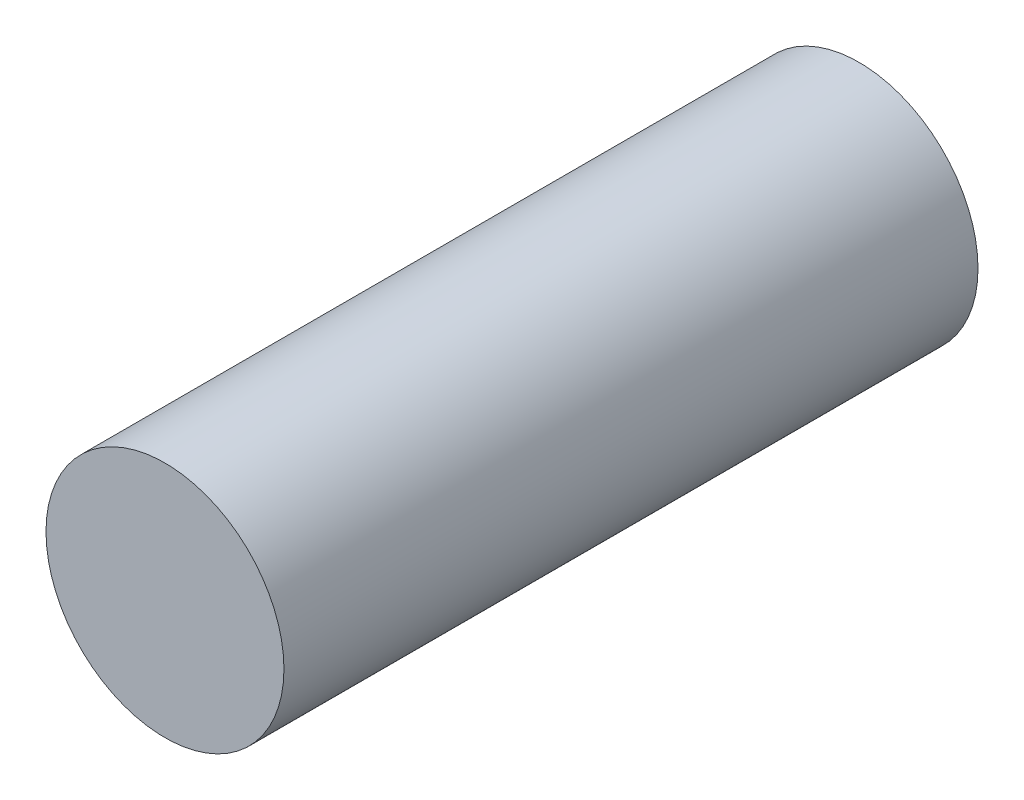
ISO-10303-21;
HEADER;
FILE_DESCRIPTION(('STEP AP214'),'2;1');
FILE_NAME('part.step','',(''),(''),'','','');
FILE_SCHEMA(('AUTOMOTIVE_DESIGN { 1 0 10303 214 1 1 1 1 }'));
ENDSEC;
DATA;
#1=APPLICATION_CONTEXT('core data for automotive mechanical design processes');
#2=APPLICATION_PROTOCOL_DEFINITION('international standard','automotive_design',2000,#1);
#3=PRODUCT_CONTEXT('',#1,'mechanical');
#4=PRODUCT('Part','Part','',(#3));
#5=PRODUCT_RELATED_PRODUCT_CATEGORY('part','',(#4));
#6=PRODUCT_DEFINITION_FORMATION('','',#4);
#7=PRODUCT_DEFINITION_CONTEXT('part definition',#1,'design');
#8=PRODUCT_DEFINITION('design','',#6,#7);
#9=PRODUCT_DEFINITION_SHAPE('','',#8);
#10=(LENGTH_UNIT() NAMED_UNIT(*) SI_UNIT(.MILLI.,.METRE.));
#11=(NAMED_UNIT(*) PLANE_ANGLE_UNIT() SI_UNIT($,.RADIAN.));
#12=(NAMED_UNIT(*) SI_UNIT($,.STERADIAN.) SOLID_ANGLE_UNIT());
#13=UNCERTAINTY_MEASURE_WITH_UNIT(LENGTH_MEASURE(1.E-05),#10,'distance_accuracy_value','');
#14=(GEOMETRIC_REPRESENTATION_CONTEXT(3) GLOBAL_UNCERTAINTY_ASSIGNED_CONTEXT((#13)) GLOBAL_UNIT_ASSIGNED_CONTEXT((#10,
#11,#12)) REPRESENTATION_CONTEXT('',''));
#15=CARTESIAN_POINT('',(0.,0.,0.));
#16=DIRECTION('',(0.,0.,1.));
#17=DIRECTION('',(1.,0.,0.));
#18=AXIS2_PLACEMENT_3D('',#15,#16,#17);
#19=CARTESIAN_POINT('',(0.,0.,10.5));
#20=DIRECTION('',(0.,0.,-1.));
#21=DIRECTION('',(-1.,0.,0.));
#22=AXIS2_PLACEMENT_3D('',#19,#20,#21);
#23=CYLINDRICAL_SURFACE('',#22,1.8);
#24=CARTESIAN_POINT('',(0.,0.,10.5));
#25=DIRECTION('',(0.,0.,1.));
#26=DIRECTION('',(1.,0.,0.));
#27=AXIS2_PLACEMENT_3D('',#24,#25,#26);
#28=CIRCLE('',#27,1.8);
#29=CARTESIAN_POINT('',(-1.8,0.,10.5));
#30=VERTEX_POINT('',#29);
#31=EDGE_CURVE('E10',#30,#30,#28,.T.);
#32=CARTESIAN_POINT('',(0.,0.,0.));
#33=DIRECTION('',(0.,0.,1.));
#34=DIRECTION('',(1.,0.,0.));
#35=AXIS2_PLACEMENT_3D('',#32,#33,#34);
#36=CIRCLE('',#35,1.8);
#37=CARTESIAN_POINT('',(-1.8,0.,0.));
#38=VERTEX_POINT('',#37);
#39=EDGE_CURVE('E44',#38,#38,#36,.T.);
#40=CARTESIAN_POINT('',(-1.8,0.,10.5));
#41=CARTESIAN_POINT('',(-1.8,0.,10.390625));
#42=CARTESIAN_POINT('',(-1.8,0.,10.28125));
#43=CARTESIAN_POINT('',(-1.8,0.,10.0625));
#44=CARTESIAN_POINT('',(-1.8,0.,9.953125));
#45=CARTESIAN_POINT('',(-1.8,0.,9.734375));
#46=CARTESIAN_POINT('',(-1.8,0.,9.625));
#47=CARTESIAN_POINT('',(-1.8,0.,9.40625));
#48=CARTESIAN_POINT('',(-1.8,0.,9.296875));
#49=CARTESIAN_POINT('',(-1.8,0.,9.078125));
#50=CARTESIAN_POINT('',(-1.8,0.,8.96875));
#51=CARTESIAN_POINT('',(-1.8,0.,8.75));
#52=CARTESIAN_POINT('',(-1.8,0.,8.640625));
#53=CARTESIAN_POINT('',(-1.8,0.,8.421875));
#54=CARTESIAN_POINT('',(-1.8,0.,8.3125));
#55=CARTESIAN_POINT('',(-1.8,0.,8.09375));
#56=CARTESIAN_POINT('',(-1.8,0.,7.984375));
#57=CARTESIAN_POINT('',(-1.8,0.,7.765625));
#58=CARTESIAN_POINT('',(-1.8,0.,7.65625));
#59=CARTESIAN_POINT('',(-1.8,0.,7.4375));
#60=CARTESIAN_POINT('',(-1.8,0.,7.328125));
#61=CARTESIAN_POINT('',(-1.8,0.,7.109375));
#62=CARTESIAN_POINT('',(-1.8,0.,7.));
#63=CARTESIAN_POINT('',(-1.8,0.,6.78125));
#64=CARTESIAN_POINT('',(-1.8,0.,6.671875));
#65=CARTESIAN_POINT('',(-1.8,0.,6.453125));
#66=CARTESIAN_POINT('',(-1.8,0.,6.34375));
#67=CARTESIAN_POINT('',(-1.8,0.,6.125));
#68=CARTESIAN_POINT('',(-1.8,0.,6.015625));
#69=CARTESIAN_POINT('',(-1.8,0.,5.796875));
#70=CARTESIAN_POINT('',(-1.8,0.,5.6875));
#71=CARTESIAN_POINT('',(-1.8,0.,5.46875));
#72=CARTESIAN_POINT('',(-1.8,0.,5.359375));
#73=CARTESIAN_POINT('',(-1.8,0.,5.140625));
#74=CARTESIAN_POINT('',(-1.8,0.,5.03125));
#75=CARTESIAN_POINT('',(-1.8,0.,4.8125));
#76=CARTESIAN_POINT('',(-1.8,0.,4.703125));
#77=CARTESIAN_POINT('',(-1.8,0.,4.484375));
#78=CARTESIAN_POINT('',(-1.8,0.,4.375));
#79=CARTESIAN_POINT('',(-1.8,0.,4.15625));
#80=CARTESIAN_POINT('',(-1.8,0.,4.046875));
#81=CARTESIAN_POINT('',(-1.8,0.,3.828125));
#82=CARTESIAN_POINT('',(-1.8,0.,3.71875));
#83=CARTESIAN_POINT('',(-1.8,0.,3.5));
#84=CARTESIAN_POINT('',(-1.8,0.,3.390625));
#85=CARTESIAN_POINT('',(-1.8,0.,3.171875));
#86=CARTESIAN_POINT('',(-1.8,0.,3.0625));
#87=CARTESIAN_POINT('',(-1.8,0.,2.84375));
#88=CARTESIAN_POINT('',(-1.8,0.,2.734375));
#89=CARTESIAN_POINT('',(-1.8,0.,2.515625));
#90=CARTESIAN_POINT('',(-1.8,0.,2.40625));
#91=CARTESIAN_POINT('',(-1.8,0.,2.1875));
#92=CARTESIAN_POINT('',(-1.8,0.,2.078125));
#93=CARTESIAN_POINT('',(-1.8,0.,1.859375));
#94=CARTESIAN_POINT('',(-1.8,0.,1.75));
#95=CARTESIAN_POINT('',(-1.8,0.,1.53125));
#96=CARTESIAN_POINT('',(-1.8,0.,1.421875));
#97=CARTESIAN_POINT('',(-1.8,0.,1.203125));
#98=CARTESIAN_POINT('',(-1.8,0.,1.09375));
#99=CARTESIAN_POINT('',(-1.8,0.,0.875000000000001));
#100=CARTESIAN_POINT('',(-1.8,0.,0.765625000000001));
#101=CARTESIAN_POINT('',(-1.8,0.,0.546875));
#102=CARTESIAN_POINT('',(-1.8,0.,0.4375));
#103=CARTESIAN_POINT('',(-1.8,0.,0.21875));
#104=CARTESIAN_POINT('',(-1.8,0.,0.109375));
#105=CARTESIAN_POINT('',(-1.8,0.,0.));
#106=B_SPLINE_CURVE_WITH_KNOTS('',3,(#40,#41,#42,#43,#44,#45,#46,#47,#48,#49,#50,#51,#52,#53,
#54,#55,#56,#57,#58,#59,#60,#61,#62,#63,#64,#65,#66,#67,#68,#69,#70,#71,#72,#73,#74,#75,#76,#77,
#78,#79,#80,#81,#82,#83,#84,#85,#86,#87,#88,#89,#90,#91,#92,#93,#94,#95,#96,#97,#98,#99,#100,
#101,#102,#103,#104,#105),.UNSPECIFIED.,.F.,.F.,(4,2,2,2,2,2,2,2,2,2,2,2,2,2,2,2,2,2,2,2,2,2,2,
2,2,2,2,2,2,2,2,2,4),(0.,0.328124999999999,0.656249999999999,0.984374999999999,1.3125,1.640625,
1.96875,2.296875,2.625,2.953125,3.28125,3.609375,3.9375,4.265625,4.59375,4.921875,5.25,5.578125,
5.90625,6.234375,6.5625,6.890625,7.21875,7.546875,7.875,8.203125,8.53125,8.859375,9.1875,
9.515625,9.84375,10.171875,10.5),.UNSPECIFIED.);
#107=EDGE_CURVE('BSEAM41',#30,#38,#106,.T.);
#108=ORIENTED_EDGE('',*,*,#31,.F.);
#109=ORIENTED_EDGE('',*,*,#39,.T.);
#110=ORIENTED_EDGE('',*,*,#107,.T.);
#111=ORIENTED_EDGE('',*,*,#107,.F.);
#112=EDGE_LOOP('',(#108,#110,#109,#111));
#113=FACE_BOUND('',#112,.T.);
#114=ADVANCED_FACE('F41',(#113),#23,.T.);
#115=CARTESIAN_POINT('',(0.,0.,10.5));
#116=DIRECTION('',(0.,0.,1.));
#117=DIRECTION('',(1.,0.,0.));
#118=AXIS2_PLACEMENT_3D('',#115,#116,#117);
#119=PLANE('',#118);
#120=ORIENTED_EDGE('',*,*,#31,.T.);
#121=EDGE_LOOP('',(#120));
#122=FACE_BOUND('',#121,.T.);
#123=ADVANCED_FACE('F58',(#122),#119,.T.);
#124=CARTESIAN_POINT('',(0.,0.,0.));
#125=DIRECTION('',(0.,0.,1.));
#126=DIRECTION('',(1.,0.,0.));
#127=AXIS2_PLACEMENT_3D('',#124,#125,#126);
#128=PLANE('',#127);
#129=ORIENTED_EDGE('',*,*,#39,.F.);
#130=EDGE_LOOP('',(#129));
#131=FACE_BOUND('',#130,.T.);
#132=ADVANCED_FACE('F56',(#131),#128,.F.);
#133=CLOSED_SHELL('',(#114,#123,#132));
#134=MANIFOLD_SOLID_BREP('B2',#133);
#135=ADVANCED_BREP_SHAPE_REPRESENTATION('',(#18,#134),#14);
#136=SHAPE_DEFINITION_REPRESENTATION(#9,#135);
ENDSEC;
END-ISO-10303-21;
